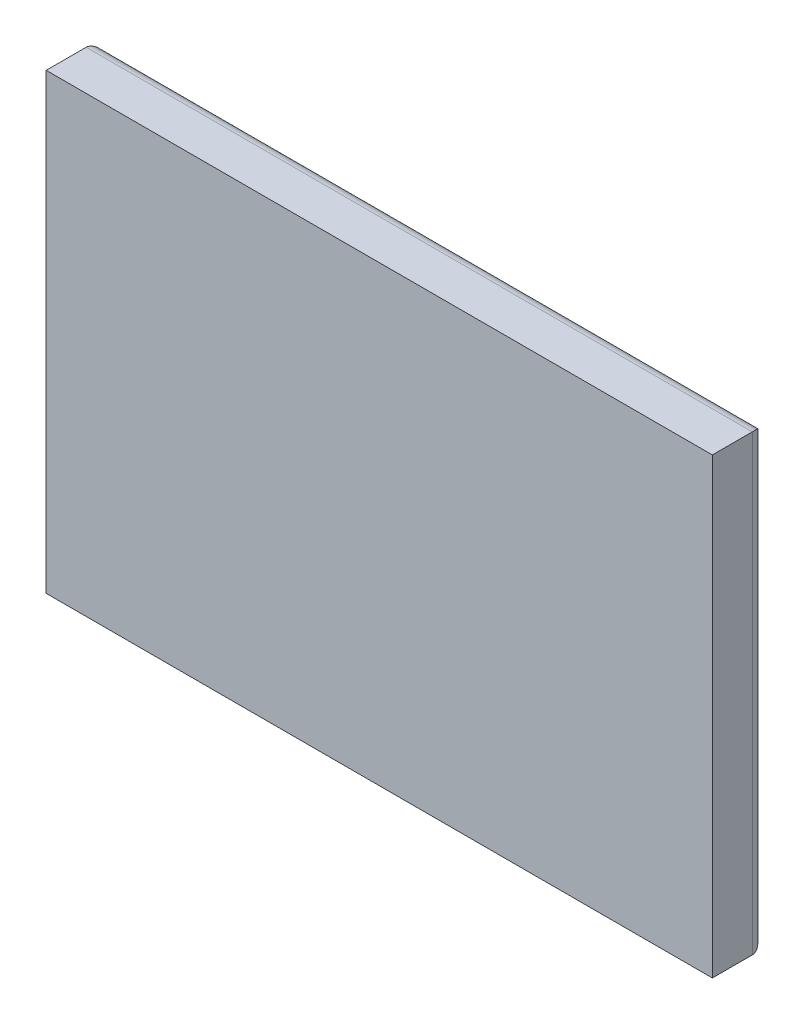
from build123d import *

# Parameters (mm, degrees)
SKETCH1_W           = 31.75
SKETCH1_H           = 21.59
BOSS_EXTRUDE1_DEPTH = 2.54
FILLET1_R           = 0.635


with BuildPart() as part:
    # Sketch1 → Boss-Extrude1 (new body)
    with BuildSketch(Plane.XY):
        Rectangle(SKETCH1_W, SKETCH1_H)
    extrude(amount=BOSS_EXTRUDE1_DEPTH)

    # Fillet1
    fillet1_edges = [part.edges().sort_by_distance(p)[0] for p in [
        (0, -10.795, 0),
        (-15.875, 0, 0),
        (0, 10.795, 0),
        (15.875, 0, 0),
    ]]
    fillet(fillet1_edges, radius=FILLET1_R)


solid = part.part
